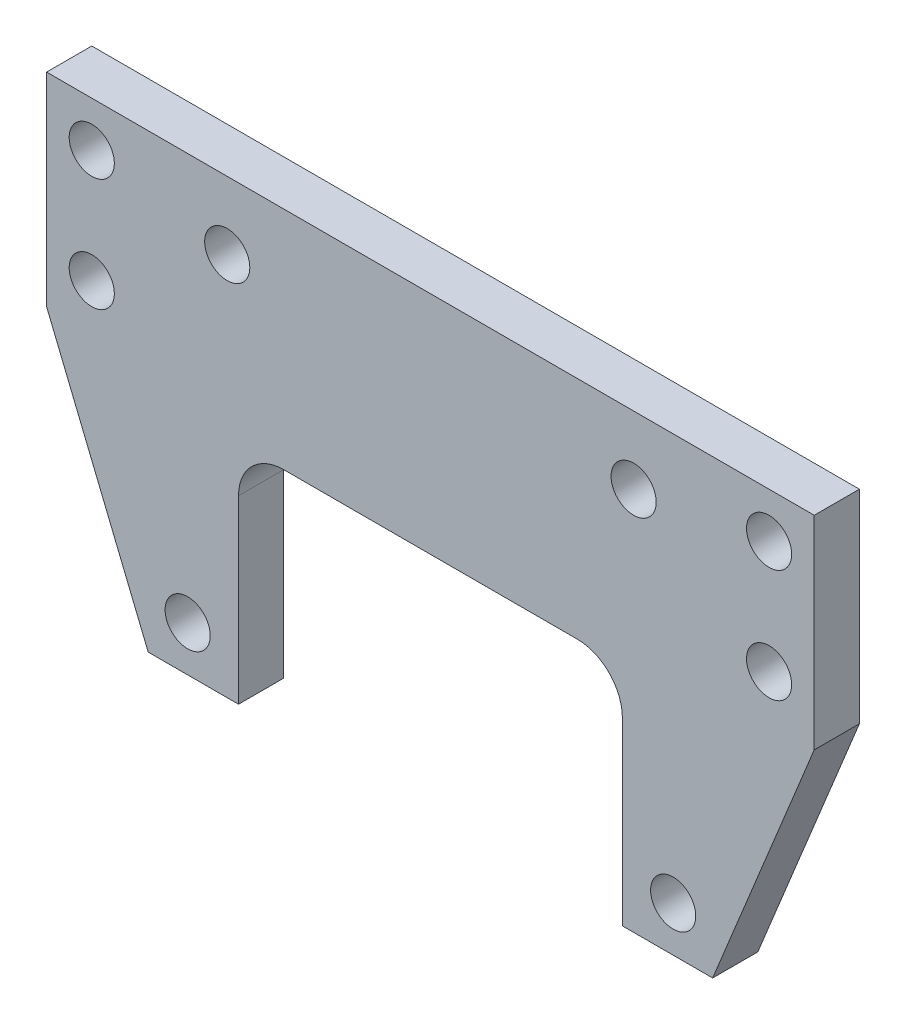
from build123d import *

# Parameters (mm, degrees)
SKETCH2_R           = 3.175
BOSS_EXTRUDE1_DEPTH = 6.35
FILLET1_R           = 6.35


with BuildPart() as part:
    # Sketch2 → Boss-Extrude1 (new body)
    with BuildSketch(Plane.XY):
        Polygon((-26.9875, -63.5), (-39.6875, -63.5), (-53.975, -28.575), (-53.975, 0), (0, 0), (53.975, 0), (53.975, -28.575), (39.6875, -63.5), (26.9875, -63.5), (26.9875, -31.75), (-26.9875, -31.75), align=None)
        with Locations((-34.1376, -57.15)):
            Circle(SKETCH2_R, mode=Mode.SUBTRACT)
        with Locations((-28.575, -9.525)):
            Circle(SKETCH2_R, mode=Mode.SUBTRACT)
        with Locations((28.575, -9.525)):
            Circle(SKETCH2_R, mode=Mode.SUBTRACT)
        with Locations((34.1376, -57.15)):
            Circle(SKETCH2_R, mode=Mode.SUBTRACT)
        with Locations((-47.625, -22.225)):
            Circle(SKETCH2_R, mode=Mode.SUBTRACT)
        with Locations((-47.625, -6.35)):
            Circle(SKETCH2_R, mode=Mode.SUBTRACT)
        with Locations((47.625, -6.35)):
            Circle(SKETCH2_R, mode=Mode.SUBTRACT)
        with Locations((47.625, -22.225)):
            Circle(SKETCH2_R, mode=Mode.SUBTRACT)
    extrude(amount=BOSS_EXTRUDE1_DEPTH)

    # Fillet1
    fillet1_edges = [part.edges().sort_by_distance(p)[0] for p in [
        (26.9875, -31.75, 3.175),
        (-26.9875, -31.75, 3.175),
    ]]
    fillet(fillet1_edges, radius=FILLET1_R)


solid = part.part
